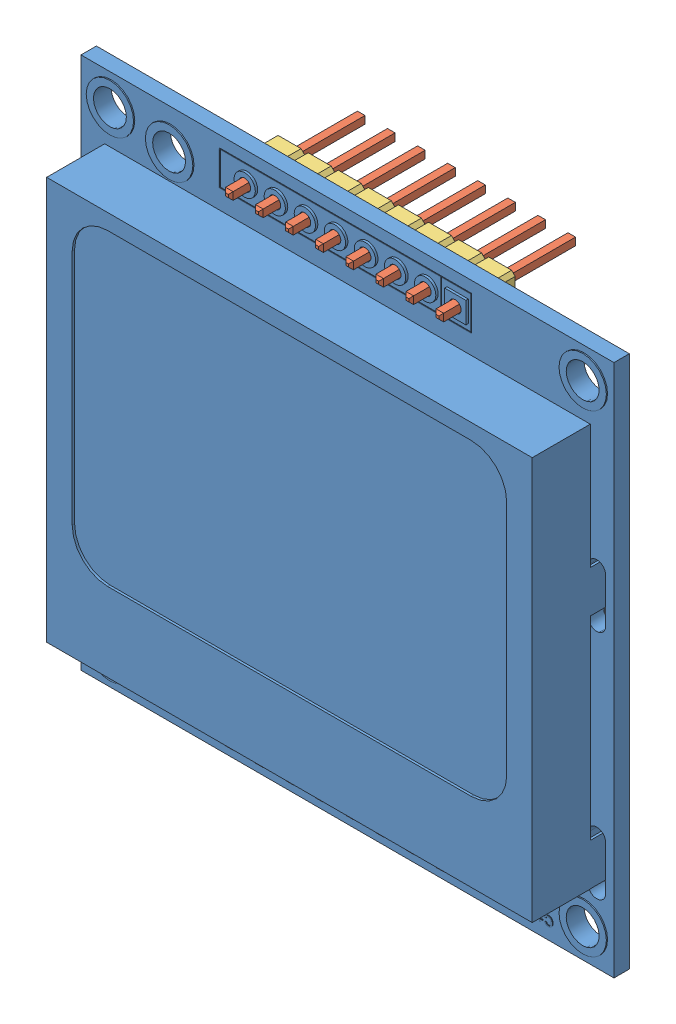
SolidWorks assembly Nokia 5110 - 84x48 LCD.SLDASM, configuration Default (file format 9000). Lengths in mm.
Overall size (45 45 14.74).
7 component instances, 3 part files, 7 mates.
Components (placement in the parent):
- Graphic LCD Nokia 5110-1: Graphic LCD Nokia 5110.SLDPRT [Default] at (-9.0468 -1.7 35.6394) size (45 45 7.02)
- Header_Male_8Pin-1: Header_Male_8Pin.sldasm [Default] at (22.7532 0.7 35.4394) x (-1 0 0) z (0 0 -1) size (20.32 2.49 11.54)
  - Header_Male_8Pin_PinArray-1: Header_Male_8Pin_PinArray.sldprt [Default] at origin size (18.42 0.64 11.54)
  - Header_Male_8Pin_BodyArray-1: Header_Male_8Pin_BodyArray.sldprt [Default] at origin size (20.32 2.49 2.29)
- Header_Male_8Pin-2: Header_Male_8Pin.sldasm [Default] at (22.7532 40.9 35.4394) x (-1 0 0) z (0 0 -1) size (20.32 2.49 11.54)
  - Header_Male_8Pin_PinArray-1: Header_Male_8Pin_PinArray.sldprt [Default] at origin size (18.42 0.64 11.54)
  - Header_Male_8Pin_BodyArray-1: Header_Male_8Pin_BodyArray.sldprt [Default] at origin size (20.32 2.49 2.29)
Mates (geometry in assembly coordinates):
- Coincident1: coincident anti-aligned: plane of Graphic LCD Nokia 5110-1 through (-9.0468 -1.7 35.4394) normal (0 0 -1); plane of Header_Male_8Pin-1/Header_Male_8Pin_BodyArray-1 through (24.0232 1.945 35.4394) normal (0 0 1)
- Parallel1: parallel aligned: plane of Graphic LCD Nokia 5110-1 through (-9.0468 -1.7 35.4394) normal (0 -1 0); plane of Header_Male_8Pin-1/Header_Male_8Pin_BodyArray-1 through (3.7032 -0.545 35.4394) normal (0 -1 0)
- Width1: width anti-aligned: plane of Header_Male_8Pin-1/Header_Male_8Pin_PinArray-1 through (22.4332 1.02 38.4394) normal (-1 0 0); plane of Header_Male_8Pin-1/Header_Male_8Pin_PinArray-1 through (23.0732 0.38 38.4394) normal (1 0 0); plane of Graphic LCD Nokia 5110-1 through (23.6532 -0.2 35.3394) normal (1 0 0); plane of Graphic LCD Nokia 5110-1 through (21.8532 -0.2 35.3394) normal (-1 0 0)
- Width2: width anti-aligned: plane of Header_Male_8Pin-1/Header_Male_8Pin_PinArray-1 through (22.4332 0.38 38.4394) normal (0 -1 0); plane of Header_Male_8Pin-1/Header_Male_8Pin_PinArray-1 through (23.0732 1.02 38.4394) normal (0 1 0); plane of Graphic LCD Nokia 5110-1 through (21.8532 1.6 35.3394) normal (0 1 0); plane of Graphic LCD Nokia 5110-1 through (21.8532 -0.2 35.3394) normal (0 -1 0)
- Width3: width aligned: plane of Header_Male_8Pin-2/Header_Male_8Pin_PinArray-1 through (4.6532 40.58 38.4394) normal (0 -1 0); plane of Header_Male_8Pin-2/Header_Male_8Pin_PinArray-1 through (5.2932 41.22 38.4394) normal (0 1 0); plane of Graphic LCD Nokia 5110-1 through (21.8532 40 35.3394) normal (0 -1 0); plane of Graphic LCD Nokia 5110-1 through (21.8532 41.8 35.3394) normal (0 1 0)
- Coincident9: coincident anti-aligned: plane of Graphic LCD Nokia 5110-1 through (-9.0468 -1.7 35.4394) normal (0 0 -1); plane of Header_Male_8Pin-2/Header_Male_8Pin_BodyArray-1 through (6.2432 42.145 35.4394) normal (0 0 1)
- Width5: width aligned: plane of Header_Male_8Pin-2/Header_Male_8Pin_PinArray-1 through (22.4332 41.22 38.4394) normal (-1 0 0); plane of Header_Male_8Pin-2/Header_Male_8Pin_PinArray-1 through (23.0732 40.58 38.4394) normal (1 0 0); plane of Graphic LCD Nokia 5110-1 through (21.8532 41.8 35.3394) normal (-1 0 0); plane of Graphic LCD Nokia 5110-1 through (23.6532 41.8 35.3394) normal (1 0 0)
